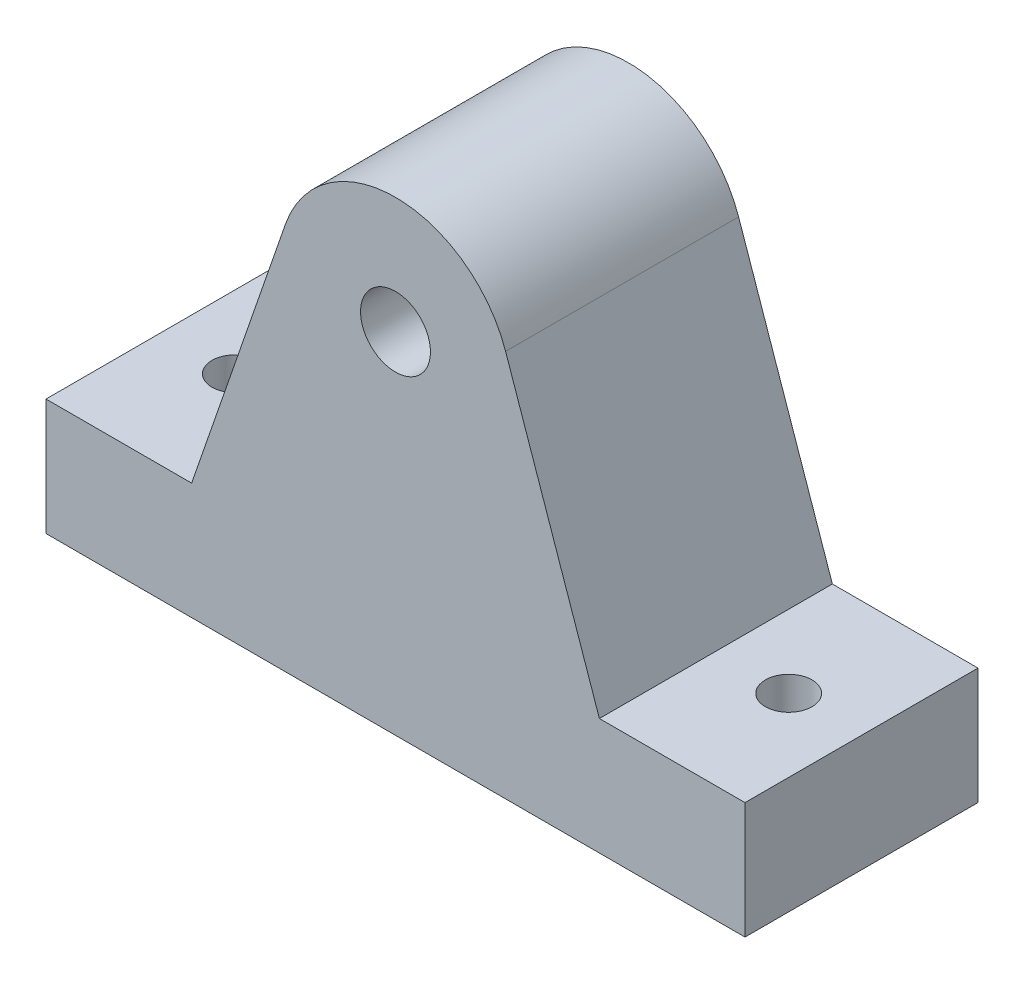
from build123d import *

# Parameters (mm, degrees)
SKETCH1_R           = 3
BOSS_EXTRUDE1_DEPTH = 20
SKETCH2_R           = 2
CUT_EXTRUDE1_DEPTH  = 47.904157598


with BuildPart() as part:
    # Sketch1 → Boss-Extrude1 (new body)
    with BuildSketch(Plane.XY):
        with BuildLine():
            Line((-30, 0), (30, 0))
            Line((30, 0), (30, 10))
            Line((30, 10), (17.5, 10))
            Line((17.5, 10), (9.450518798, 33.269203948))
            ThreePointArc((9.450518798, 33.269203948), (0, 40), (-9.450518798, 33.269203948))
            Line((-9.450518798, 33.269203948), (-17.5, 10))
            Line((-17.5, 10), (-30, 10))
            Line((-30, 10), (-30, 0))
        make_face()
        with Locations((0, 30)):
            Circle(SKETCH1_R, mode=Mode.SUBTRACT)
    extrude(amount=BOSS_EXTRUDE1_DEPTH)

    # Sketch2 → Cut-Extrude1 (cut, through all)
    with BuildSketch(Plane(origin=(0, 10, 0), x_dir=(1, 0, 0), z_dir=(0, 1, 0))):
        with Locations(Location((-23.75, -10, 0), (0, 0, 180))):
            Circle(SKETCH2_R)
        with Locations((23.75, -10)):
            Circle(SKETCH2_R)
    extrude(amount=-CUT_EXTRUDE1_DEPTH, mode=Mode.SUBTRACT)


solid = part.part
